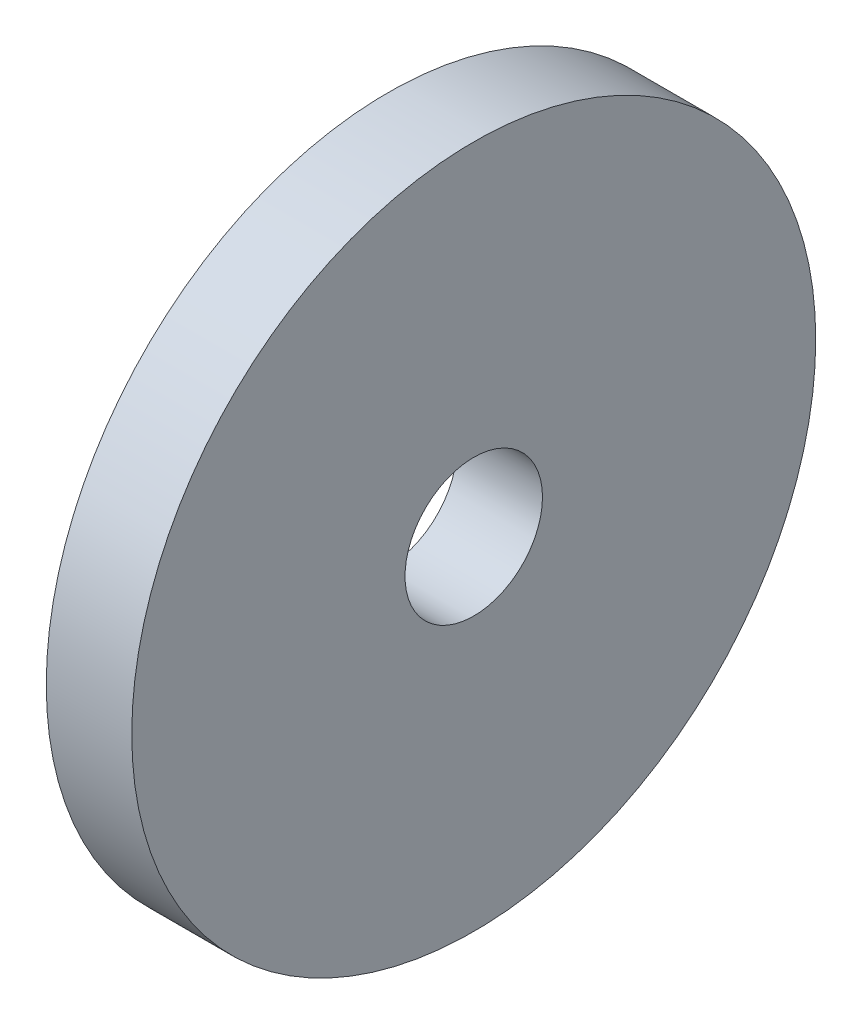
ISO-10303-21;
HEADER;
FILE_DESCRIPTION(('STEP AP214'),'2;1');
FILE_NAME('part.step','',(''),(''),'','','');
FILE_SCHEMA(('AUTOMOTIVE_DESIGN { 1 0 10303 214 1 1 1 1 }'));
ENDSEC;
DATA;
#1=APPLICATION_CONTEXT('core data for automotive mechanical design processes');
#2=APPLICATION_PROTOCOL_DEFINITION('international standard','automotive_design',2000,#1);
#3=PRODUCT_CONTEXT('',#1,'mechanical');
#4=PRODUCT('Part','Part','',(#3));
#5=PRODUCT_RELATED_PRODUCT_CATEGORY('part','',(#4));
#6=PRODUCT_DEFINITION_FORMATION('','',#4);
#7=PRODUCT_DEFINITION_CONTEXT('part definition',#1,'design');
#8=PRODUCT_DEFINITION('design','',#6,#7);
#9=PRODUCT_DEFINITION_SHAPE('','',#8);
#10=(LENGTH_UNIT() NAMED_UNIT(*) SI_UNIT(.MILLI.,.METRE.));
#11=(NAMED_UNIT(*) PLANE_ANGLE_UNIT() SI_UNIT($,.RADIAN.));
#12=(NAMED_UNIT(*) SI_UNIT($,.STERADIAN.) SOLID_ANGLE_UNIT());
#13=UNCERTAINTY_MEASURE_WITH_UNIT(LENGTH_MEASURE(1.E-05),#10,'distance_accuracy_value','');
#14=(GEOMETRIC_REPRESENTATION_CONTEXT(3) GLOBAL_UNCERTAINTY_ASSIGNED_CONTEXT((#13)) GLOBAL_UNIT_ASSIGNED_CONTEXT((#10,
#11,#12)) REPRESENTATION_CONTEXT('',''));
#15=CARTESIAN_POINT('',(0.,0.,0.));
#16=DIRECTION('',(0.,0.,1.));
#17=DIRECTION('',(1.,0.,0.));
#18=AXIS2_PLACEMENT_3D('',#15,#16,#17);
#19=CARTESIAN_POINT('',(3.175,0.,0.));
#20=DIRECTION('',(-1.,0.,0.));
#21=DIRECTION('',(0.,0.,1.));
#22=AXIS2_PLACEMENT_3D('',#19,#20,#21);
#23=CYLINDRICAL_SURFACE('',#22,12.7);
#24=CARTESIAN_POINT('',(3.175,0.,0.));
#25=DIRECTION('',(1.,0.,0.));
#26=DIRECTION('',(0.,0.,-1.));
#27=AXIS2_PLACEMENT_3D('',#24,#25,#26);
#28=CIRCLE('',#27,12.7);
#29=CARTESIAN_POINT('',(3.175,0.,-12.7));
#30=VERTEX_POINT('',#29);
#31=EDGE_CURVE('E10',#30,#30,#28,.T.);
#32=ORIENTED_EDGE('',*,*,#31,.F.);
#33=EDGE_LOOP('',(#32));
#34=FACE_BOUND('',#33,.T.);
#35=CARTESIAN_POINT('',(0.,0.,0.));
#36=DIRECTION('',(1.,0.,0.));
#37=DIRECTION('',(0.,0.,-1.));
#38=AXIS2_PLACEMENT_3D('',#35,#36,#37);
#39=CIRCLE('',#38,12.7);
#40=CARTESIAN_POINT('',(0.,0.,-12.7));
#41=VERTEX_POINT('',#40);
#42=EDGE_CURVE('E36',#41,#41,#39,.T.);
#43=ORIENTED_EDGE('',*,*,#42,.T.);
#44=EDGE_LOOP('',(#43));
#45=FACE_BOUND('',#44,.T.);
#46=ADVANCED_FACE('F33',(#34,#45),#23,.T.);
#47=CARTESIAN_POINT('',(3.175,0.,0.));
#48=DIRECTION('',(1.,0.,0.));
#49=DIRECTION('',(0.,0.,-1.));
#50=AXIS2_PLACEMENT_3D('',#47,#48,#49);
#51=PLANE('',#50);
#52=CARTESIAN_POINT('',(3.175,0.,0.));
#53=DIRECTION('',(1.,0.,0.));
#54=DIRECTION('',(0.,0.,-1.));
#55=AXIS2_PLACEMENT_3D('',#52,#53,#54);
#56=CIRCLE('',#55,2.55269999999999);
#57=CARTESIAN_POINT('',(3.175,0.,-2.55269999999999));
#58=VERTEX_POINT('',#57);
#59=EDGE_CURVE('E47',#58,#58,#56,.T.);
#60=ORIENTED_EDGE('',*,*,#59,.F.);
#61=EDGE_LOOP('',(#60));
#62=FACE_BOUND('',#61,.T.);
#63=ORIENTED_EDGE('',*,*,#31,.T.);
#64=EDGE_LOOP('',(#63));
#65=FACE_BOUND('',#64,.T.);
#66=ADVANCED_FACE('F53',(#62,#65),#51,.T.);
#67=CARTESIAN_POINT('',(0.,0.,0.));
#68=DIRECTION('',(1.,0.,0.));
#69=DIRECTION('',(0.,0.,-1.));
#70=AXIS2_PLACEMENT_3D('',#67,#68,#69);
#71=PLANE('',#70);
#72=CARTESIAN_POINT('',(0.,0.,0.));
#73=DIRECTION('',(1.,0.,0.));
#74=DIRECTION('',(0.,0.,-1.));
#75=AXIS2_PLACEMENT_3D('',#72,#73,#74);
#76=CIRCLE('',#75,2.5527);
#77=CARTESIAN_POINT('',(0.,0.,-2.5527));
#78=VERTEX_POINT('',#77);
#79=EDGE_CURVE('E43',#78,#78,#76,.T.);
#80=ORIENTED_EDGE('',*,*,#79,.T.);
#81=EDGE_LOOP('',(#80));
#82=FACE_BOUND('',#81,.T.);
#83=ORIENTED_EDGE('',*,*,#42,.F.);
#84=EDGE_LOOP('',(#83));
#85=FACE_BOUND('',#84,.T.);
#86=ADVANCED_FACE('F55',(#82,#85),#71,.F.);
#87=CARTESIAN_POINT('',(3.175,0.,0.));
#88=DIRECTION('',(1.,0.,0.));
#89=DIRECTION('',(0.,0.,-1.));
#90=AXIS2_PLACEMENT_3D('',#87,#88,#89);
#91=CYLINDRICAL_SURFACE('',#90,2.55269999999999);
#92=ORIENTED_EDGE('',*,*,#79,.F.);
#93=EDGE_LOOP('',(#92));
#94=FACE_BOUND('',#93,.T.);
#95=ORIENTED_EDGE('',*,*,#59,.T.);
#96=EDGE_LOOP('',(#95));
#97=FACE_BOUND('',#96,.T.);
#98=ADVANCED_FACE('F51',(#94,#97),#91,.F.);
#99=CLOSED_SHELL('',(#46,#66,#86,#98));
#100=MANIFOLD_SOLID_BREP('B2',#99);
#101=ADVANCED_BREP_SHAPE_REPRESENTATION('',(#18,#100),#14);
#102=SHAPE_DEFINITION_REPRESENTATION(#9,#101);
ENDSEC;
END-ISO-10303-21;
